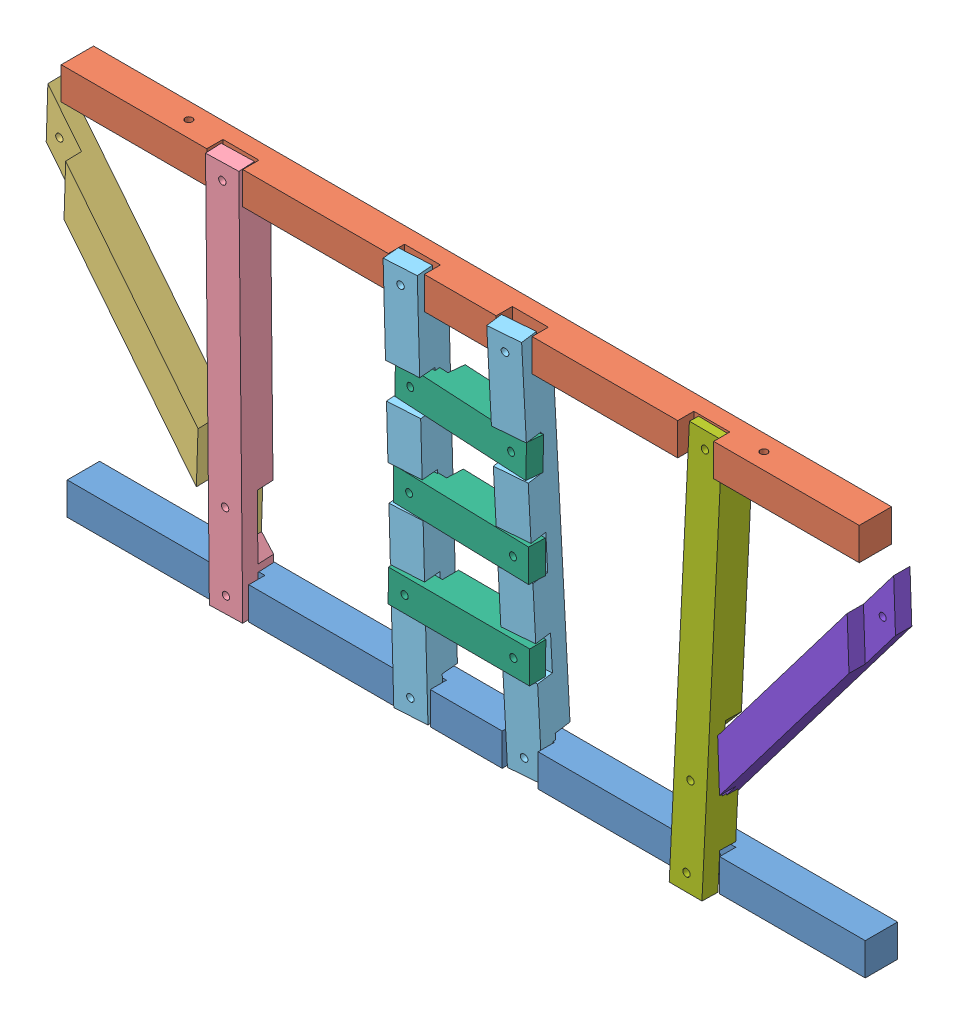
SolidWorks assembly Assemblage_G_notes.SLDASM, configuration Défaut (file format 3400). Lengths in mm.
Overall size (249.39 111.13 15.94).
11 component instances, 8 part files, 0 mates.
Components (placement in the parent):
- largeur_B-1: largeur_B.SLDPRT [Défaut] at (-110.4192 -41.287 -4.5) size (222 9 9)
- largeur_H-1: largeur_H.SLDPRT [Défaut] at (-109.8383 60.1677 -2.25) size (222 9 9)
- decharge_G1-1: decharge_G1.SLDPRT [Défaut] at (-124.7318 53.2931 -1.5065) x (0.609925 -0.792352 -0.013029) z (0.023921 0.001974 0.999712) size (100 9 9)
- montant_14-31-1: montant_14-31.SLDPRT [Default] at (-169.6587 2.0951 9.8084) x (-0.005146 -0.999876 -0.014866) z (-0.030782 0.015017 -0.999413) size (110 9 9)
- montant_32-33-1: montant_32-33.SLDPRT [Default] at (90.8935 26.4646 0.9204) x (0.001691 0.999585 0.028746) z (-0.058698 0.028796 -0.99786) size (110 9 9)
- montant_32-33-2: montant_32-33.SLDPRT [Default] at (-88.5654 1.7804 14.6997) x (-0.004319 -0.99838 -0.056726) z (-0.082352 0.056889 -0.994978) size (110 9 9)
- traverse_T4-1: traverse_T4.SLDPRT [Défaut] at (-18.6368 -6.1576 6.9412) x (0.999905 -0.010746 -0.008586) z (-0.008528 0.005416 -0.999949) size (39 9 9)
- traverse_T4-2: traverse_T4.SLDPRT [Défaut] at (-18.1397 18.287 6.0202) x (0.999309 0.008967 0.036082) z (0.036126 -0.004839 -0.999336) size (39 9 9)
- traverse_T4-3: traverse_T4.SLDPRT [Défaut] at (-18.233 43.5576 5.3559) x (0.997929 0.009791 0.063574) z (0.063851 -0.031225 -0.997471) size (39 9 9)
- montant_17-34-1: montant_17-34.SLDPRT [Default] at (-38.6308 3.1141 8.353) x (-0.015424 -0.999246 0.035627) z (-0.011676 -0.035449 -0.999303) size (110 9 9)
- decharge_D1-1: decharge_D1.SLDPRT [Défaut] at (117.4906 57.5839 -2.0374) x (-0.605173 -0.79608 -0.004798) z (-0.007756 -0.000131 0.99997) size (100 9 9)
